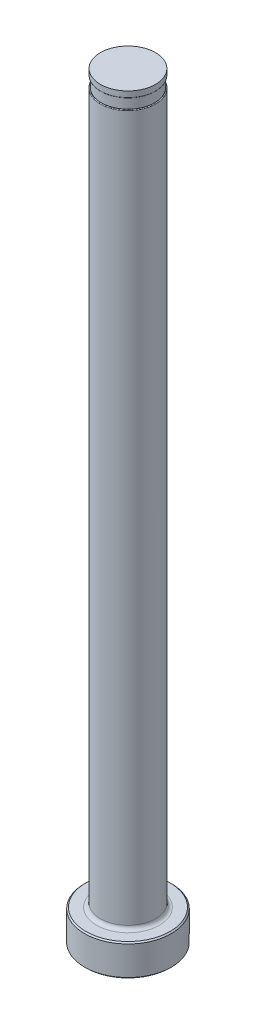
ISO-10303-21;
HEADER;
FILE_DESCRIPTION(('STEP AP214'),'2;1');
FILE_NAME('part.step','',(''),(''),'','','');
FILE_SCHEMA(('AUTOMOTIVE_DESIGN { 1 0 10303 214 1 1 1 1 }'));
ENDSEC;
DATA;
#1=APPLICATION_CONTEXT('core data for automotive mechanical design processes');
#2=APPLICATION_PROTOCOL_DEFINITION('international standard','automotive_design',2000,#1);
#3=PRODUCT_CONTEXT('',#1,'mechanical');
#4=PRODUCT('Part','Part','',(#3));
#5=PRODUCT_RELATED_PRODUCT_CATEGORY('part','',(#4));
#6=PRODUCT_DEFINITION_FORMATION('','',#4);
#7=PRODUCT_DEFINITION_CONTEXT('part definition',#1,'design');
#8=PRODUCT_DEFINITION('design','',#6,#7);
#9=PRODUCT_DEFINITION_SHAPE('','',#8);
#10=(LENGTH_UNIT() NAMED_UNIT(*) SI_UNIT(.MILLI.,.METRE.));
#11=(NAMED_UNIT(*) PLANE_ANGLE_UNIT() SI_UNIT($,.RADIAN.));
#12=(NAMED_UNIT(*) SI_UNIT($,.STERADIAN.) SOLID_ANGLE_UNIT());
#13=UNCERTAINTY_MEASURE_WITH_UNIT(LENGTH_MEASURE(1.E-05),#10,'distance_accuracy_value','');
#14=(GEOMETRIC_REPRESENTATION_CONTEXT(3) GLOBAL_UNCERTAINTY_ASSIGNED_CONTEXT((#13)) GLOBAL_UNIT_ASSIGNED_CONTEXT((#10,
#11,#12)) REPRESENTATION_CONTEXT('',''));
#15=CARTESIAN_POINT('',(0.,0.,0.));
#16=DIRECTION('',(0.,0.,1.));
#17=DIRECTION('',(1.,0.,0.));
#18=AXIS2_PLACEMENT_3D('',#15,#16,#17);
#19=CARTESIAN_POINT('',(-5.55624999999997,151.13,0.));
#20=DIRECTION('',(0.,1.,0.));
#21=DIRECTION('',(0.,0.,1.));
#22=AXIS2_PLACEMENT_3D('',#19,#20,#21);
#23=PLANE('',#22);
#24=CARTESIAN_POINT('',(0.,151.13,0.));
#25=DIRECTION('',(0.,1.,0.));
#26=DIRECTION('',(0.,0.,1.));
#27=AXIS2_PLACEMENT_3D('',#24,#25,#26);
#28=CIRCLE('',#27,5.41019999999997);
#29=CARTESIAN_POINT('',(0.,151.13,5.41019999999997));
#30=VERTEX_POINT('',#29);
#31=EDGE_CURVE('E11',#30,#30,#28,.F.);
#32=ORIENTED_EDGE('',*,*,#31,.T.);
#33=EDGE_LOOP('',(#32));
#34=FACE_BOUND('',#33,.T.);
#35=CARTESIAN_POINT('',(0.,151.13,0.));
#36=DIRECTION('',(0.,1.,0.));
#37=DIRECTION('',(0.,0.,1.));
#38=AXIS2_PLACEMENT_3D('',#35,#36,#37);
#39=CIRCLE('',#38,5.35304999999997);
#40=CARTESIAN_POINT('',(0.,151.13,5.35304999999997));
#41=VERTEX_POINT('',#40);
#42=EDGE_CURVE('E78',#41,#41,#39,.T.);
#43=ORIENTED_EDGE('',*,*,#42,.T.);
#44=EDGE_LOOP('',(#43));
#45=FACE_BOUND('',#44,.T.);
#46=ADVANCED_FACE('F36',(#34,#45),#23,.F.);
#47=CARTESIAN_POINT('',(0.,259.958771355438,0.));
#48=DIRECTION('',(0.,1.,0.));
#49=DIRECTION('',(0.,0.,1.));
#50=AXIS2_PLACEMENT_3D('',#47,#48,#49);
#51=CYLINDRICAL_SURFACE('',#50,5.55624999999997);
#52=DIRECTION('',(0.,1.,0.));
#53=VECTOR('',#52,1.);
#54=CARTESIAN_POINT('',(-5.35304999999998,259.958771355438,-1.48888205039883));
#55=LINE('',#54,#53);
#56=CARTESIAN_POINT('',(-5.35304999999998,148.971,-1.48888205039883));
#57=VERTEX_POINT('',#56);
#58=CARTESIAN_POINT('',(-5.35304999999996,86.614,-1.48888205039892));
#59=VERTEX_POINT('',#58);
#60=EDGE_CURVE('E73',#57,#59,#55,.F.);
#61=ORIENTED_EDGE('',*,*,#60,.F.);
#62=CARTESIAN_POINT('',(0.,148.971,0.));
#63=DIRECTION('',(0.,-1.,0.));
#64=DIRECTION('',(0.,0.,-1.));
#65=AXIS2_PLACEMENT_3D('',#62,#63,#64);
#66=CIRCLE('',#65,5.55624999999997);
#67=CARTESIAN_POINT('',(-5.35304999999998,148.971,1.48888205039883));
#68=VERTEX_POINT('',#67);
#69=EDGE_CURVE('E51',#57,#68,#66,.T.);
#70=ORIENTED_EDGE('',*,*,#69,.T.);
#71=DIRECTION('',(0.,1.,0.));
#72=VECTOR('',#71,1.);
#73=CARTESIAN_POINT('',(-5.35304999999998,259.958771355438,1.48888205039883));
#74=LINE('',#73,#72);
#75=CARTESIAN_POINT('',(-5.35304999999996,86.614,1.48888205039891));
#76=VERTEX_POINT('',#75);
#77=EDGE_CURVE('E84',#76,#68,#74,.T.);
#78=ORIENTED_EDGE('',*,*,#77,.F.);
#79=CARTESIAN_POINT('',(-5.35304999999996,86.614,-1.48888205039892));
#80=CARTESIAN_POINT('',(-5.35304712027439,86.5859400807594,-1.48888592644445));
#81=CARTESIAN_POINT('',(-5.35342246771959,86.557898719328,-1.48754344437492));
#82=CARTESIAN_POINT('',(-5.35490012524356,86.5021072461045,-1.48221807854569));
#83=CARTESIAN_POINT('',(-5.3560019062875,86.4743569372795,-1.47823711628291));
#84=CARTESIAN_POINT('',(-5.36032637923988,86.3923774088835,-1.46251079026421));
#85=CARTESIAN_POINT('',(-5.36456936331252,86.338885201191,-1.44697968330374));
#86=CARTESIAN_POINT('',(-5.37522073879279,86.2358696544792,-1.40688871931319));
#87=CARTESIAN_POINT('',(-5.38162399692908,86.1863372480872,-1.38235025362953));
#88=CARTESIAN_POINT('',(-5.39588416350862,86.0920393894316,-1.3255962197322));
#89=CARTESIAN_POINT('',(-5.40374399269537,86.0472838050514,-1.29336518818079));
#90=CARTESIAN_POINT('',(-5.42234104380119,85.9520810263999,-1.21335067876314));
#91=CARTESIAN_POINT('',(-5.43329059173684,85.9032435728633,-1.16370716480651));
#92=CARTESIAN_POINT('',(-5.45504519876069,85.8143973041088,-1.05705847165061));
#93=CARTESIAN_POINT('',(-5.46585002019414,85.7744016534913,-1.0000425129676));
#94=CARTESIAN_POINT('',(-5.48941062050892,85.6922379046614,-0.862814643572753));
#95=CARTESIAN_POINT('',(-5.50177933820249,85.6530172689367,-0.780775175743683));
#96=CARTESIAN_POINT('',(-5.52319531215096,85.5880184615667,-0.61119833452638));
#97=CARTESIAN_POINT('',(-5.53224012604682,85.5622501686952,-0.523656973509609));
#98=CARTESIAN_POINT('',(-5.54633656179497,85.5229210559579,-0.343981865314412));
#99=CARTESIAN_POINT('',(-5.551315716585,85.5095811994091,-0.251794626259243));
#100=CARTESIAN_POINT('',(-5.55663041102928,85.4953656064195,-0.0663077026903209));
#101=CARTESIAN_POINT('',(-5.5569631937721,85.4944972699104,0.0269926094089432));
#102=CARTESIAN_POINT('',(-5.55261816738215,85.5060778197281,0.228128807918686));
#103=CARTESIAN_POINT('',(-5.5471061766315,85.5207433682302,0.335828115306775));
#104=CARTESIAN_POINT('',(-5.53028051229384,85.5677503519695,0.546872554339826));
#105=CARTESIAN_POINT('',(-5.51897217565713,85.60007552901,0.650221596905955));
#106=CARTESIAN_POINT('',(-5.49592210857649,85.6717771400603,0.81966257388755));
#107=CARTESIAN_POINT('',(-5.48524552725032,85.7064328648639,0.88790475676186));
#108=CARTESIAN_POINT('',(-5.46261932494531,85.7860662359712,1.01785270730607));
#109=CARTESIAN_POINT('',(-5.45067176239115,85.8310273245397,1.07956873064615));
#110=CARTESIAN_POINT('',(-5.42934912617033,85.9209408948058,1.18161350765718));
#111=CARTESIAN_POINT('',(-5.41996423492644,85.9638853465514,1.22370530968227));
#112=CARTESIAN_POINT('',(-5.40207756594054,86.0562163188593,1.30039205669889));
#113=CARTESIAN_POINT('',(-5.3935749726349,86.1055967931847,1.33499395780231));
#114=CARTESIAN_POINT('',(-5.37957377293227,86.2020291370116,1.39024779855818));
#115=CARTESIAN_POINT('',(-5.37381465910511,86.2482834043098,1.4122235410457));
#116=CARTESIAN_POINT('',(-5.36419527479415,86.3439194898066,1.44833565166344));
#117=CARTESIAN_POINT('',(-5.36033174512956,86.3932957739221,1.46248548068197));
#118=CARTESIAN_POINT('',(-5.3561211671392,86.4715749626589,1.47780624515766));
#119=CARTESIAN_POINT('',(-5.35497463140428,86.49988137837,1.48194947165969));
#120=CARTESIAN_POINT('',(-5.35343719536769,86.5567860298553,1.48749027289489));
#121=CARTESIAN_POINT('',(-5.35304641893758,86.5853843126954,1.4888873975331));
#122=CARTESIAN_POINT('',(-5.35304999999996,86.614,1.48888205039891));
#123=B_SPLINE_CURVE_WITH_KNOTS('',3,(#79,#80,#81,#82,#83,#84,#85,#86,#87,#88,#89,#90,#91,#92,
#93,#94,#95,#96,#97,#98,#99,#100,#101,#102,#103,#104,#105,#106,#107,#108,#109,#110,#111,#112,
#113,#114,#115,#116,#117,#118,#119,#120,#121,#122),.UNSPECIFIED.,.F.,.F.,(4,2,2,2,2,2,2,2,2,2,2,
2,2,2,2,2,2,2,2,2,2,4),(0.,0.0841097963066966,0.168158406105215,0.334679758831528,
0.50080817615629,0.667273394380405,0.87762078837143,1.0882792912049,1.36213137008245,
1.63618427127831,1.91502141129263,2.19402399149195,2.51897339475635,2.84362413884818,
3.07466463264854,3.30533648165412,3.48723774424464,3.66896933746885,3.82292542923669,
3.97661588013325,4.06237930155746,4.14815677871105),.UNSPECIFIED.);
#124=EDGE_CURVE('E81',#59,#76,#123,.T.);
#125=ORIENTED_EDGE('',*,*,#124,.F.);
#126=EDGE_LOOP('',(#61,#70,#78,#125));
#127=FACE_BOUND('',#126,.T.);
#128=CARTESIAN_POINT('',(0.,7.11200000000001,0.));
#129=DIRECTION('',(0.,1.,0.));
#130=DIRECTION('',(0.,0.,1.));
#131=AXIS2_PLACEMENT_3D('',#128,#129,#130);
#132=CIRCLE('',#131,5.55624999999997);
#133=CARTESIAN_POINT('',(0.,7.11200000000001,5.55624999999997));
#134=VERTEX_POINT('',#133);
#135=EDGE_CURVE('E116',#134,#134,#132,.T.);
#136=ORIENTED_EDGE('',*,*,#135,.T.);
#137=EDGE_LOOP('',(#136));
#138=FACE_BOUND('',#137,.T.);
#139=ADVANCED_FACE('F82',(#127,#138),#51,.T.);
#140=CARTESIAN_POINT('',(0.,0.,0.));
#141=DIRECTION('',(0.,-1.,0.));
#142=DIRECTION('',(0.,0.,-1.));
#143=AXIS2_PLACEMENT_3D('',#140,#141,#142);
#144=PLANE('',#143);
#145=CARTESIAN_POINT('',(0.,0.,0.));
#146=DIRECTION('',(0.,-1.,0.));
#147=DIRECTION('',(0.,0.,-1.));
#148=AXIS2_PLACEMENT_3D('',#145,#146,#147);
#149=CIRCLE('',#148,8.47089999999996);
#150=CARTESIAN_POINT('',(0.,0.,-8.47089999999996));
#151=VERTEX_POINT('',#150);
#152=EDGE_CURVE('E113',#151,#151,#149,.T.);
#153=ORIENTED_EDGE('',*,*,#152,.T.);
#154=EDGE_LOOP('',(#153));
#155=FACE_BOUND('',#154,.T.);
#156=ADVANCED_FACE('F192',(#155),#144,.T.);
#157=CARTESIAN_POINT('',(0.,259.958771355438,0.));
#158=DIRECTION('',(0.,1.,0.));
#159=DIRECTION('',(0.,0.,1.));
#160=AXIS2_PLACEMENT_3D('',#157,#158,#159);
#161=CYLINDRICAL_SURFACE('',#160,8.72489999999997);
#162=CARTESIAN_POINT('',(0.,6.09600000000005,0.));
#163=DIRECTION('',(0.,1.,0.));
#164=DIRECTION('',(0.,0.,1.));
#165=AXIS2_PLACEMENT_3D('',#162,#163,#164);
#166=CIRCLE('',#165,8.72489999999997);
#167=CARTESIAN_POINT('',(0.,6.09600000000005,8.72489999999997));
#168=VERTEX_POINT('',#167);
#169=EDGE_CURVE('E110',#168,#168,#166,.F.);
#170=ORIENTED_EDGE('',*,*,#169,.T.);
#171=EDGE_LOOP('',(#170));
#172=FACE_BOUND('',#171,.T.);
#173=CARTESIAN_POINT('',(0.,0.254000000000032,0.));
#174=DIRECTION('',(0.,-1.,0.));
#175=DIRECTION('',(0.,0.,-1.));
#176=AXIS2_PLACEMENT_3D('',#173,#174,#175);
#177=CIRCLE('',#176,8.72489999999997);
#178=CARTESIAN_POINT('',(0.,0.254000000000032,-8.72489999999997));
#179=VERTEX_POINT('',#178);
#180=EDGE_CURVE('E107',#179,#179,#177,.F.);
#181=ORIENTED_EDGE('',*,*,#180,.T.);
#182=EDGE_LOOP('',(#181));
#183=FACE_BOUND('',#182,.T.);
#184=ADVANCED_FACE('F195',(#172,#183),#161,.T.);
#185=CARTESIAN_POINT('',(-8.72489999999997,6.35,0.));
#186=DIRECTION('',(0.,1.,0.));
#187=DIRECTION('',(0.,0.,1.));
#188=AXIS2_PLACEMENT_3D('',#185,#186,#187);
#189=PLANE('',#188);
#190=CARTESIAN_POINT('',(0.,6.35,0.));
#191=DIRECTION('',(0.,1.,0.));
#192=DIRECTION('',(0.,0.,1.));
#193=AXIS2_PLACEMENT_3D('',#190,#191,#192);
#194=CIRCLE('',#193,6.31824999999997);
#195=CARTESIAN_POINT('',(0.,6.35,6.31824999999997));
#196=VERTEX_POINT('',#195);
#197=EDGE_CURVE('E87',#196,#196,#194,.F.);
#198=ORIENTED_EDGE('',*,*,#197,.T.);
#199=EDGE_LOOP('',(#198));
#200=FACE_BOUND('',#199,.T.);
#201=CARTESIAN_POINT('',(0.,6.35,0.));
#202=DIRECTION('',(0.,1.,0.));
#203=DIRECTION('',(0.,0.,1.));
#204=AXIS2_PLACEMENT_3D('',#201,#202,#203);
#205=CIRCLE('',#204,8.47090000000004);
#206=CARTESIAN_POINT('',(0.,6.35,8.47090000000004));
#207=VERTEX_POINT('',#206);
#208=EDGE_CURVE('E104',#207,#207,#205,.T.);
#209=ORIENTED_EDGE('',*,*,#208,.T.);
#210=EDGE_LOOP('',(#209));
#211=FACE_BOUND('',#210,.T.);
#212=ADVANCED_FACE('F190',(#200,#211),#189,.T.);
#213=CARTESIAN_POINT('',(0.,6.35000000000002,0.));
#214=DIRECTION('',(0.,-1.,0.));
#215=DIRECTION('',(0.,0.,-1.));
#216=AXIS2_PLACEMENT_3D('',#213,#214,#215);
#217=CONICAL_SURFACE('',#216,8.47090000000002,0.785398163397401);
#218=ORIENTED_EDGE('',*,*,#169,.F.);
#219=EDGE_LOOP('',(#218));
#220=FACE_BOUND('',#219,.T.);
#221=ORIENTED_EDGE('',*,*,#208,.F.);
#222=EDGE_LOOP('',(#221));
#223=FACE_BOUND('',#222,.T.);
#224=ADVANCED_FACE('F186',(#220,#223),#217,.T.);
#225=CARTESIAN_POINT('',(0.,0.254000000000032,0.));
#226=DIRECTION('',(0.,1.,0.));
#227=DIRECTION('',(0.,0.,1.));
#228=AXIS2_PLACEMENT_3D('',#225,#226,#227);
#229=CONICAL_SURFACE('',#228,8.72489999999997,0.785398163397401);
#230=ORIENTED_EDGE('',*,*,#152,.F.);
#231=EDGE_LOOP('',(#230));
#232=FACE_BOUND('',#231,.T.);
#233=ORIENTED_EDGE('',*,*,#180,.F.);
#234=EDGE_LOOP('',(#233));
#235=FACE_BOUND('',#234,.T.);
#236=ADVANCED_FACE('F182',(#232,#235),#229,.T.);
#237=CARTESIAN_POINT('',(0.,7.11200000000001,0.));
#238=DIRECTION('',(0.,1.,0.));
#239=DIRECTION('',(0.,0.,1.));
#240=AXIS2_PLACEMENT_3D('',#237,#238,#239);
#241=TOROIDAL_SURFACE('',#240,6.31824999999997,0.762);
#242=ORIENTED_EDGE('',*,*,#197,.F.);
#243=EDGE_LOOP('',(#242));
#244=FACE_BOUND('',#243,.T.);
#245=ORIENTED_EDGE('',*,*,#135,.F.);
#246=EDGE_LOOP('',(#245));
#247=FACE_BOUND('',#246,.T.);
#248=ADVANCED_FACE('F147',(#244,#247),#241,.F.);
#249=CARTESIAN_POINT('',(-5.55624999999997,149.098,0.));
#250=DIRECTION('',(0.,-1.,0.));
#251=DIRECTION('',(0.,0.,-1.));
#252=AXIS2_PLACEMENT_3D('',#249,#250,#251);
#253=PLANE('',#252);
#254=DIRECTION('',(0.,0.,1.));
#255=VECTOR('',#254,1.);
#256=CARTESIAN_POINT('',(-5.35304999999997,149.098,0.));
#257=LINE('',#256,#255);
#258=CARTESIAN_POINT('',(-5.35304999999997,149.098,0.));
#259=VERTEX_POINT('',#258);
#260=CARTESIAN_POINT('',(-5.35304999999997,149.098,0.906427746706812));
#261=VERTEX_POINT('',#260);
#262=EDGE_CURVE('E90',#259,#261,#257,.T.);
#263=ORIENTED_EDGE('',*,*,#262,.T.);
#264=CARTESIAN_POINT('',(0.,149.098,0.));
#265=DIRECTION('',(0.,-1.,0.));
#266=DIRECTION('',(0.,0.,-1.));
#267=AXIS2_PLACEMENT_3D('',#264,#265,#266);
#268=CIRCLE('',#267,5.42924999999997);
#269=CARTESIAN_POINT('',(-5.35304999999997,149.098,-0.906427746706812));
#270=VERTEX_POINT('',#269);
#271=EDGE_CURVE('E86',#261,#270,#268,.F.);
#272=ORIENTED_EDGE('',*,*,#271,.T.);
#273=EDGE_CURVE('E79',#270,#259,#257,.T.);
#274=ORIENTED_EDGE('',*,*,#273,.T.);
#275=CARTESIAN_POINT('',(0.,149.098,0.));
#276=DIRECTION('',(0.,1.,0.));
#277=DIRECTION('',(0.,0.,1.));
#278=AXIS2_PLACEMENT_3D('',#275,#276,#277);
#279=CIRCLE('',#278,5.35304999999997);
#280=EDGE_CURVE('E101',#259,#259,#279,.T.);
#281=ORIENTED_EDGE('',*,*,#280,.F.);
#282=EDGE_LOOP('',(#263,#272,#274,#281));
#283=FACE_BOUND('',#282,.T.);
#284=ADVANCED_FACE('F144',(#283),#253,.F.);
#285=CARTESIAN_POINT('',(0.,153.448281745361,0.));
#286=DIRECTION('',(0.,1.,0.));
#287=DIRECTION('',(0.,0.,1.));
#288=AXIS2_PLACEMENT_3D('',#285,#286,#287);
#289=CYLINDRICAL_SURFACE('',#288,5.35304999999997);
#290=ORIENTED_EDGE('',*,*,#42,.F.);
#291=EDGE_LOOP('',(#290));
#292=FACE_BOUND('',#291,.T.);
#293=ORIENTED_EDGE('',*,*,#280,.T.);
#294=EDGE_LOOP('',(#293));
#295=FACE_BOUND('',#294,.T.);
#296=ADVANCED_FACE('F141',(#292,#295),#289,.T.);
#297=CARTESIAN_POINT('',(-5.35304999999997,150.114,-8.72489999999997));
#298=DIRECTION('',(1.,0.,0.));
#299=DIRECTION('',(0.,1.,0.));
#300=AXIS2_PLACEMENT_3D('',#297,#298,#299);
#301=PLANE('',#300);
#302=ORIENTED_EDGE('',*,*,#273,.F.);
#303=CARTESIAN_POINT('',(-5.35304999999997,149.098,-0.906427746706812));
#304=CARTESIAN_POINT('',(-5.35304999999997,149.097997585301,-0.927323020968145));
#305=CARTESIAN_POINT('',(-5.35304999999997,149.097856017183,-0.94821957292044));
#306=CARTESIAN_POINT('',(-5.35304999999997,149.097220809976,-0.990022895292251));
#307=CARTESIAN_POINT('',(-5.35304999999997,149.09672690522,-1.01092966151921));
#308=CARTESIAN_POINT('',(-5.35304999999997,149.095293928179,-1.05329459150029));
#309=CARTESIAN_POINT('',(-5.35304999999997,149.094343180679,-1.07475238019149));
#310=CARTESIAN_POINT('',(-5.35304999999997,149.091886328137,-1.11762595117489));
#311=CARTESIAN_POINT('',(-5.35304999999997,149.090380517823,-1.13904174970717));
#312=CARTESIAN_POINT('',(-5.35304999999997,149.086668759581,-1.18182014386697));
#313=CARTESIAN_POINT('',(-5.35304999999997,149.084462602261,-1.20318272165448));
#314=CARTESIAN_POINT('',(-5.35304999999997,149.079137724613,-1.24583267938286));
#315=CARTESIAN_POINT('',(-5.35304999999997,149.076017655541,-1.26711990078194));
#316=CARTESIAN_POINT('',(-5.35304999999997,149.068562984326,-1.30920547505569));
#317=CARTESIAN_POINT('',(-5.35304999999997,149.064244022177,-1.33000661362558));
#318=CARTESIAN_POINT('',(-5.35304999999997,149.053803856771,-1.37114198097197));
#319=CARTESIAN_POINT('',(-5.35304999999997,149.047688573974,-1.39147751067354));
#320=CARTESIAN_POINT('',(-5.35304999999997,149.037778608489,-1.41655009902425));
#321=CARTESIAN_POINT('',(-5.35304999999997,149.035524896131,-1.4218879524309));
#322=CARTESIAN_POINT('',(-5.35304999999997,149.030682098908,-1.43243190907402));
#323=CARTESIAN_POINT('',(-5.35304999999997,149.028092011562,-1.43763756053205));
#324=CARTESIAN_POINT('',(-5.35304999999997,149.022182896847,-1.44837668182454));
#325=CARTESIAN_POINT('',(-5.35304999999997,149.018815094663,-1.45388357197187));
#326=CARTESIAN_POINT('',(-5.35304999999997,149.011355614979,-1.4643862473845));
#327=CARTESIAN_POINT('',(-5.35304999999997,149.007267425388,-1.46938432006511));
#328=CARTESIAN_POINT('',(-5.35304999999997,149.000750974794,-1.47569818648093));
#329=CARTESIAN_POINT('',(-5.35304999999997,148.998754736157,-1.47745487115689));
#330=CARTESIAN_POINT('',(-5.35304999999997,148.994555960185,-1.4807071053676));
#331=CARTESIAN_POINT('',(-5.35304999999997,148.992353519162,-1.48220277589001));
#332=CARTESIAN_POINT('',(-5.35304999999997,148.988086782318,-1.48462572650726));
#333=CARTESIAN_POINT('',(-5.35304999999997,148.986052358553,-1.48560484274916));
#334=CARTESIAN_POINT('',(-5.35304999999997,148.981851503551,-1.48721324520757));
#335=CARTESIAN_POINT('',(-5.35304999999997,148.979685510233,-1.48784362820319));
#336=CARTESIAN_POINT('',(-5.35304999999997,148.976414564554,-1.48846795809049));
#337=CARTESIAN_POINT('',(-5.35304999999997,148.975338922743,-1.48862246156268));
#338=CARTESIAN_POINT('',(-5.35304999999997,148.973175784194,-1.48882979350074));
#339=CARTESIAN_POINT('',(-5.35304999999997,148.972088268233,-1.48888242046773));
#340=CARTESIAN_POINT('',(-5.35304999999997,148.971,-1.48888205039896));
#341=B_SPLINE_CURVE_WITH_KNOTS('',3,(#303,#304,#305,#306,#307,#308,#309,#310,#311,#312,#313,
#314,#315,#316,#317,#318,#319,#320,#321,#322,#323,#324,#325,#326,#327,#328,#329,#330,#331,#332,
#333,#334,#335,#336,#337,#338,#339,#340),.UNSPECIFIED.,.F.,.F.,(4,2,2,2,2,2,2,2,2,2,2,2,2,2,2,2,
2,2,4),(0.,0.06268730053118,0.125421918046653,0.189852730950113,0.254249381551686,
0.318665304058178,0.383176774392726,0.446883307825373,0.510382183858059,0.527756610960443,
0.54518406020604,0.564521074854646,0.583766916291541,0.591729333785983,0.599688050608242,
0.606437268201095,0.61316513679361,0.616420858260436,0.619683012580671),.UNSPECIFIED.);
#342=EDGE_CURVE('E59',#270,#57,#341,.T.);
#343=ORIENTED_EDGE('',*,*,#342,.T.);
#344=ORIENTED_EDGE('',*,*,#60,.T.);
#345=DIRECTION('',(0.,0.,1.));
#346=VECTOR('',#345,1.);
#347=CARTESIAN_POINT('',(-5.35304999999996,86.614,-8.72489999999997));
#348=LINE('',#347,#346);
#349=EDGE_CURVE('E77',#59,#76,#348,.T.);
#350=ORIENTED_EDGE('',*,*,#349,.T.);
#351=ORIENTED_EDGE('',*,*,#77,.T.);
#352=CARTESIAN_POINT('',(-5.35304999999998,148.971,1.48888205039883));
#353=CARTESIAN_POINT('',(-5.35304999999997,148.973315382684,1.48889020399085));
#354=CARTESIAN_POINT('',(-5.35304999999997,148.975618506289,1.48864616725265));
#355=CARTESIAN_POINT('',(-5.35304999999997,148.980103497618,1.48773344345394));
#356=CARTESIAN_POINT('',(-5.35304999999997,148.982286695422,1.48707143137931));
#357=CARTESIAN_POINT('',(-5.35304999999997,148.987009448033,1.48520073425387));
#358=CARTESIAN_POINT('',(-5.35304999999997,148.989511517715,1.4838999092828));
#359=CARTESIAN_POINT('',(-5.35304999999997,148.99428827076,1.48091465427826));
#360=CARTESIAN_POINT('',(-5.35304999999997,148.996561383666,1.47922780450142));
#361=CARTESIAN_POINT('',(-5.35304999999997,149.002524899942,1.47421628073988));
#362=CARTESIAN_POINT('',(-5.35304999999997,149.005983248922,1.47061948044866));
#363=CARTESIAN_POINT('',(-5.35304999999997,149.012372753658,1.46299694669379));
#364=CARTESIAN_POINT('',(-5.35304999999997,149.015302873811,1.45897039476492));
#365=CARTESIAN_POINT('',(-5.35304999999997,149.02218028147,1.44851786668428));
#366=CARTESIAN_POINT('',(-5.35304999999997,149.02587230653,1.44192584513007));
#367=CARTESIAN_POINT('',(-5.35304999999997,149.032640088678,1.42842790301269));
#368=CARTESIAN_POINT('',(-5.35304999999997,149.035714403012,1.42152129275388));
#369=CARTESIAN_POINT('',(-5.35304999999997,149.044282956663,1.40046246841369));
#370=CARTESIAN_POINT('',(-5.35304999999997,149.049087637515,1.38603333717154));
#371=CARTESIAN_POINT('',(-5.35304999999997,149.061626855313,1.34303383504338));
#372=CARTESIAN_POINT('',(-5.35304999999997,149.067813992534,1.31403988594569));
#373=CARTESIAN_POINT('',(-5.35304999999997,149.077934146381,1.25562656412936));
#374=CARTESIAN_POINT('',(-5.35304999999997,149.08186080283,1.22620622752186));
#375=CARTESIAN_POINT('',(-5.35304999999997,149.088178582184,1.16719231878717));
#376=CARTESIAN_POINT('',(-5.35304999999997,149.090569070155,1.13759868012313));
#377=CARTESIAN_POINT('',(-5.35304999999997,149.094250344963,1.07838180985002));
#378=CARTESIAN_POINT('',(-5.35304999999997,149.095542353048,1.04875864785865));
#379=CARTESIAN_POINT('',(-5.35304999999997,149.096983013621,1.00031217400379));
#380=CARTESIAN_POINT('',(-5.35304999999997,149.09737689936,0.98149542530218));
#381=CARTESIAN_POINT('',(-5.35304999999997,149.097884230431,0.943928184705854));
#382=CARTESIAN_POINT('',(-5.35304999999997,149.097998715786,0.925177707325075));
#383=CARTESIAN_POINT('',(-5.35304999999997,149.098,0.906427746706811));
#384=B_SPLINE_CURVE_WITH_KNOTS('',3,(#352,#353,#354,#355,#356,#357,#358,#359,#360,#361,#362,
#363,#364,#365,#366,#367,#368,#369,#370,#371,#372,#373,#374,#375,#376,#377,#378,#379,#380,#381,
#382,#383),.UNSPECIFIED.,.F.,.F.,(4,2,2,2,2,2,2,2,2,2,2,2,2,2,2,4),(0.,0.00691371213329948,
0.0137197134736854,0.0221318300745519,0.0305981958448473,0.0454833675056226,0.0603974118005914,
0.0830067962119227,0.105668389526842,0.151203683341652,0.23995736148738,0.328959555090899,
0.417998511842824,0.506938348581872,0.563399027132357,0.619649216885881),.UNSPECIFIED.);
#385=EDGE_CURVE('E172',#68,#261,#384,.T.);
#386=ORIENTED_EDGE('',*,*,#385,.T.);
#387=ORIENTED_EDGE('',*,*,#262,.F.);
#388=EDGE_LOOP('',(#302,#343,#344,#350,#351,#386,#387));
#389=FACE_BOUND('',#388,.T.);
#390=ADVANCED_FACE('F75',(#389),#301,.F.);
#391=CARTESIAN_POINT('',(-8.52804999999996,86.614,-8.72489999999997));
#392=DIRECTION('',(0.,0.,1.));
#393=DIRECTION('',(1.,0.,0.));
#394=AXIS2_PLACEMENT_3D('',#391,#392,#393);
#395=CYLINDRICAL_SURFACE('',#394,3.175);
#396=ORIENTED_EDGE('',*,*,#349,.F.);
#397=ORIENTED_EDGE('',*,*,#124,.T.);
#398=EDGE_LOOP('',(#396,#397));
#399=FACE_BOUND('',#398,.T.);
#400=ADVANCED_FACE('F89',(#399),#395,.F.);
#401=CARTESIAN_POINT('',(0.,152.687735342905,0.));
#402=DIRECTION('',(0.,1.,0.));
#403=DIRECTION('',(0.,0.,1.));
#404=AXIS2_PLACEMENT_3D('',#401,#402,#403);
#405=CYLINDRICAL_SURFACE('',#404,5.53719999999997);
#406=CARTESIAN_POINT('',(0.,151.257,0.));
#407=DIRECTION('',(0.,1.,0.));
#408=DIRECTION('',(0.,0.,1.));
#409=AXIS2_PLACEMENT_3D('',#406,#407,#408);
#410=CIRCLE('',#409,5.53719999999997);
#411=CARTESIAN_POINT('',(0.,151.257,5.53719999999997));
#412=VERTEX_POINT('',#411);
#413=EDGE_CURVE('E44',#412,#412,#410,.T.);
#414=ORIENTED_EDGE('',*,*,#413,.T.);
#415=EDGE_LOOP('',(#414));
#416=FACE_BOUND('',#415,.T.);
#417=CARTESIAN_POINT('',(0.,152.4,0.));
#418=DIRECTION('',(0.,1.,0.));
#419=DIRECTION('',(0.,0.,1.));
#420=AXIS2_PLACEMENT_3D('',#417,#418,#419);
#421=CIRCLE('',#420,5.53719999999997);
#422=CARTESIAN_POINT('',(0.,152.4,5.53719999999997));
#423=VERTEX_POINT('',#422);
#424=EDGE_CURVE('E91',#423,#423,#421,.T.);
#425=ORIENTED_EDGE('',*,*,#424,.F.);
#426=EDGE_LOOP('',(#425));
#427=FACE_BOUND('',#426,.T.);
#428=ADVANCED_FACE('F135',(#416,#427),#405,.T.);
#429=CARTESIAN_POINT('',(-5.55624999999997,152.4,0.));
#430=DIRECTION('',(0.,1.,0.));
#431=DIRECTION('',(0.,0.,1.));
#432=AXIS2_PLACEMENT_3D('',#429,#430,#431);
#433=PLANE('',#432);
#434=ORIENTED_EDGE('',*,*,#424,.T.);
#435=EDGE_LOOP('',(#434));
#436=FACE_BOUND('',#435,.T.);
#437=ADVANCED_FACE('F149',(#436),#433,.T.);
#438=CARTESIAN_POINT('',(0.,148.971,0.));
#439=DIRECTION('',(0.,-1.,0.));
#440=DIRECTION('',(0.,0.,-1.));
#441=AXIS2_PLACEMENT_3D('',#438,#439,#440);
#442=TOROIDAL_SURFACE('',#441,5.42924999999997,0.127);
#443=ORIENTED_EDGE('',*,*,#385,.F.);
#444=ORIENTED_EDGE('',*,*,#69,.F.);
#445=ORIENTED_EDGE('',*,*,#342,.F.);
#446=ORIENTED_EDGE('',*,*,#271,.F.);
#447=EDGE_LOOP('',(#443,#444,#445,#446));
#448=FACE_BOUND('',#447,.T.);
#449=ADVANCED_FACE('F151',(#448),#442,.T.);
#450=CARTESIAN_POINT('',(0.,151.257,0.));
#451=DIRECTION('',(0.,1.,0.));
#452=DIRECTION('',(0.,0.,1.));
#453=AXIS2_PLACEMENT_3D('',#450,#451,#452);
#454=TOROIDAL_SURFACE('',#453,5.41019999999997,0.127);
#455=ORIENTED_EDGE('',*,*,#31,.F.);
#456=EDGE_LOOP('',(#455));
#457=FACE_BOUND('',#456,.T.);
#458=ORIENTED_EDGE('',*,*,#413,.F.);
#459=EDGE_LOOP('',(#458));
#460=FACE_BOUND('',#459,.T.);
#461=ADVANCED_FACE('F38',(#457,#460),#454,.T.);
#462=CLOSED_SHELL('',(#46,#139,#156,#184,#212,#224,#236,#248,#284,#296,#390,#400,#428,#437,#449,#461));
#463=MANIFOLD_SOLID_BREP('B2',#462);
#464=ADVANCED_BREP_SHAPE_REPRESENTATION('',(#18,#463),#14);
#465=SHAPE_DEFINITION_REPRESENTATION(#9,#464);
ENDSEC;
END-ISO-10303-21;
